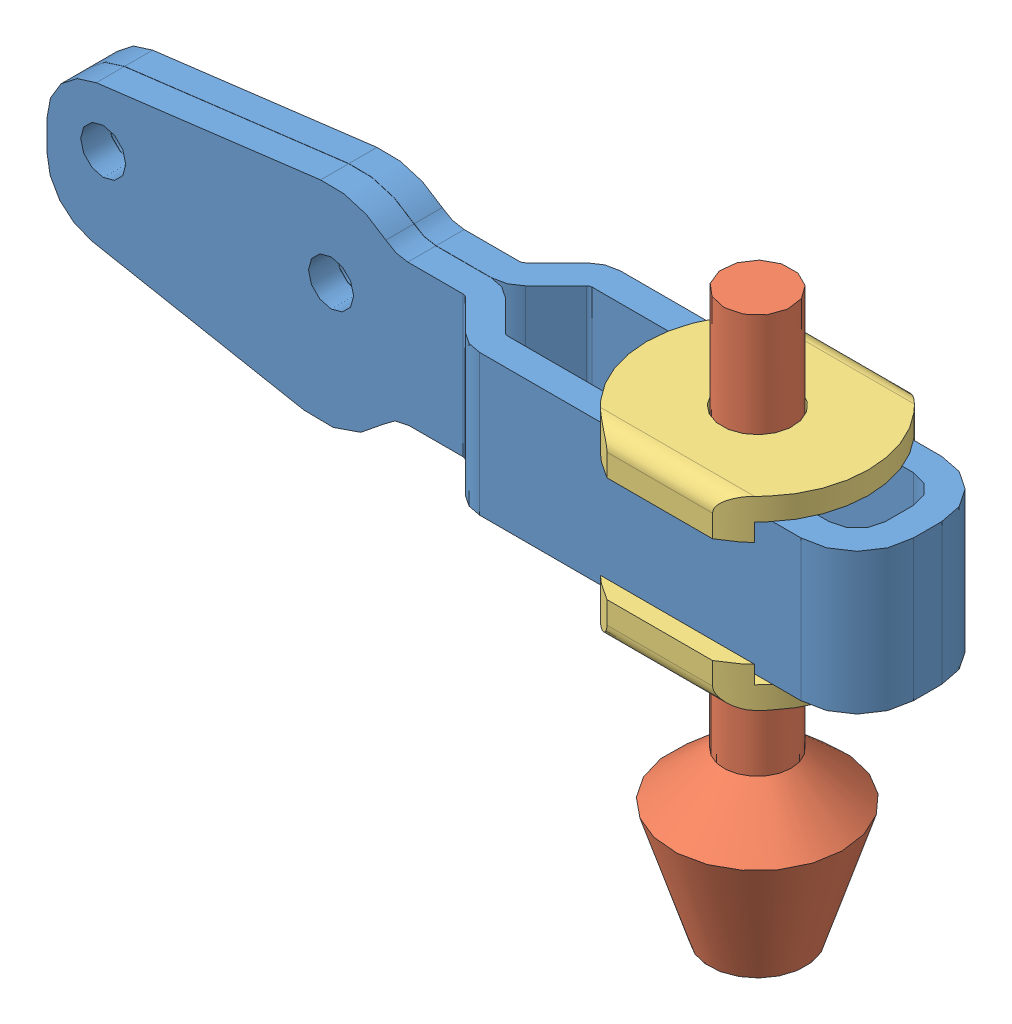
SolidWorks assembly Sensors.SLDASM, configuration Default (file format 11000). Lengths in mm.
Overall size (96.01 63.5 22).
4 component instances, 3 part files, 7 mates.
Components (placement in the parent):
- HD_Arm-1: HD_Arm.SLDPRT [Default] at origin size (96.01 23.62 15.88)
- HD_Bolt-1: HD_Bolt.sldprt [Default] at (76.837 -33.6137 0) x (-0.13714 0 -0.990552) z (0.990552 0 -0.13714) size (19.3 63.5 19.3)
- HD_Washer-1: HD_Washer.SLDPRT [Default] at (76.837 18.375 0) x (0 0 -1) z (0 -1 0) size (22 25 4.5)
- HD_Washer-2: HD_Washer.SLDPRT [Default] at (76.837 -2.5 0) x (0 0 -1) z (0 1 0) size (22 25 4.5)
Mates (geometry in assembly coordinates):
- Coincident1: coincident: plane of HD_Arm-1 through (40.6409 15.875 -7.9375) normal (0 1 0); plane of HD_Washer-1 through (76.837 15.875 0) normal (0 -1 0)
- Width1: width: plane of HD_Arm-1 through (89.662 0 7.9375) normal (0 0 1); plane of HD_Arm-1 through (89.662 0 -7.9375) normal (0 0 -1); plane of HD_Washer-1 through (85.5117 13.875 9) normal (0 0 -1); plane of HD_Washer-1 through (85.5117 13.875 -9) normal (0 0 1)
- Coincident2: coincident: plane of HD_Washer-2 through (76.837 0 0) normal (0 1 0); plane of HD_Arm-1 through (40.7775 0 -7.9375) normal (0 -1 0)
- Concentric1: concentric: cylinder of HD_Washer-1 through (76.837 15.875 0) axis (0 1 0) radius 12.5; cylinder of HD_Washer-2 through (76.837 0 0) axis (0 -1 0) radius 12.5
- Coincident3: coincident: plane of HD_Washer-1 through (82.7742 13.875 11) normal (0 0 1); plane of HD_Washer-2 through (70.8998 2 11) normal (0 0 1)
- Concentric2: concentric: cylinder of HD_Bolt-1 through (76.837 -33.6137 0) axis (0 -1 0) radius 3.81; cylinder of HD_Washer-1 through (76.837 18.375 0) axis (0 -1 0) radius 4
- Distance1: distance = 16 mm: axis of HD_Bolt-1 through (44.958 76.837 29.8863) axis (0 0 -1); plane of HD_Arm-1 through (92.837 0 -1.5875) normal (-1 0 0)
